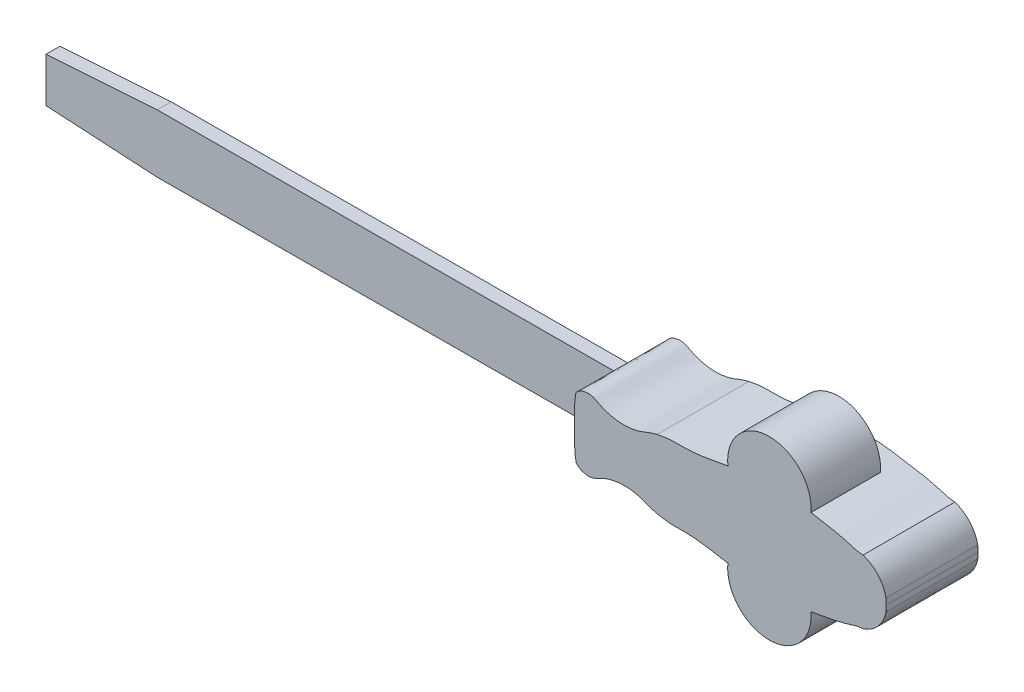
from build123d import *

# Parameters (mm, degrees)
BOSS_EXTRU_1_DEPTH      = 16.5
BOSS_EXTRU_1_DEPTH_BACK = 16.5
BOSS_EXTRU_3_DEPTH      = 25
BOSS_EXTRU_2_DEPTH      = 204
BOSS_EXTRU_2_DEPTH_BACK = 5
ESQUISSE2_W             = 5
ESQUISSE2_H             = 21
ENL_V_MAT_EXTRU_1_DEPTH = 208.421054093


with BuildPart() as part:
    # Esquisse1 → Boss.-Extru.1 (new, two sides: drawn at the far end of the back side and taken through both)
    with BuildSketch(Plane.XY.offset(-BOSS_EXTRU_1_DEPTH_BACK)):
        with BuildLine():
            add(Edge.make_bspline(
                [(-0.032865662, 3.401267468), (-0.224843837, 7.162553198), (0.44023693, 10.882257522)],
                knots=[0, 0, 0, 1, 1, 1], degree=2))
            add(Edge.make_bspline(
                [(0.44023693, 10.882257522), (1.254584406, 11.987068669), (3.198474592, 12.861745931), (6.069460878, 12.983670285), (8.102063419, 11.964714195), (10.410042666, 10.775554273), (13.186119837, 9.936569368), (16.542055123, 9.383749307), (20.171862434, 9.521311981), (24.057507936, 10.396311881), (27.077643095, 11.82091293), (29.045388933, 12.34115857), (29.658579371, 12.493288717)],
                knots=[0, 0, 0, 0, 0.120356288, 0.182103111, 0.252493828, 0.320379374, 0.416926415, 0.511670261, 0.625759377, 0.741661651, 0.867963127, 0.924773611, 0.924773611, 0.924773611, 0.924773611], degree=3))
            add(Edge.make_bspline(
                [(29.658579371, 12.493288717), (31.012865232, 12.750604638), (33.041458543, 13.211022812), (36.261256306, 13.256079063), (39.045258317, 13.257764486), (42.498505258, 13.390363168), (46.086926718, 13.792913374), (49.779062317, 14.488436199), (53.47784415, 15.15791922), (57.116896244, 15.727044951), (60.965789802, 16.271065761), (64.982894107, 16.626263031), (69.110135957, 17.089949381), (73.445124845, 17.062569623), (77.623582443, 16.967008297), (81.836310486, 16.32307468), (86.166989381, 15.637259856), (91.709301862, 14.738317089), (97.625170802, 13.482934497), (101.818778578, 11.944720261), (103.707407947, 11.990805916)],
                knots=[0, 0, 0, 0, 0.055398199, 0.08267741, 0.128818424, 0.167035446, 0.221096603, 0.273333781, 0.317568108, 0.371733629, 0.42094103, 0.473294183, 0.533363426, 0.587167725, 0.646878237, 0.700631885, 0.757710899, 0.822668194, 0.925588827, 1, 1, 1, 1], degree=3))
            add(Edge.make_bspline(
                [(103.707407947, 11.990805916), (105.281267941, 11.413367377), (109.12557011, 9.281811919), (111.416904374, 5.307594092), (111.901090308, 2.7335571)],
                knots=[0, 0, 0, 0, 0.390825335, 1, 1, 1, 1], degree=3))
            add(Edge.make_bspline(
                [(112, 0.541102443), (111.994702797, 1.637543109), (111.901090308, 2.7335571)],
                knots=[0.5, 0.5, 0.5, 1, 1, 1], degree=2))
            Line((112, 0.541102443), (0, 0))
            Line((0, 0), (-0.032865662, 3.401267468))
        make_face()
        with BuildLine():
            add(Edge.make_bspline(
                [(112, 0.541102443), (112.005297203, -0.555338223), (111.92227912, -1.652205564)],
                knots=[0.5, 0.5, 0.5, 1, 1, 1], degree=2))
            add(Edge.make_bspline(
                [(103.818425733, -10.988192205), (105.386632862, -10.395573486), (109.210159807, -8.226972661), (111.462986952, -4.230800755), (111.92227912, -1.652205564)],
                knots=[0, 0, 0, 0, 0.390825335, 1, 1, 1, 1], degree=3))
            add(Edge.make_bspline(
                [(29.777909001, -12.206134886), (31.13461791, -12.450353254), (33.16756523, -12.891149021), (36.387648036, -12.905092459), (39.171536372, -12.879877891), (42.625903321, -12.979104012), (46.218046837, -13.346962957), (49.916730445, -14.006778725), (53.621808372, -14.640491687), (57.266189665, -15.174429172), (61.120160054, -15.681235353), (65.140508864, -15.997601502), (69.272038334, -16.421387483), (73.606560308, -16.352122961), (77.783899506, -16.21619251), (81.990209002, -15.531584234), (86.314059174, -14.803957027), (91.847427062, -13.851504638), (97.750889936, -12.539019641), (101.929439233, -10.960357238), (103.818425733, -10.988192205)],
                knots=[0, 0, 0, 0, 0.055398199, 0.08267741, 0.128818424, 0.167035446, 0.221096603, 0.273333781, 0.317568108, 0.371733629, 0.42094103, 0.473294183, 0.533363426, 0.587167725, 0.646878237, 0.700631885, 0.757710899, 0.822668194, 0.925588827, 1, 1, 1, 1], degree=3))
            add(Edge.make_bspline(
                [(0.545364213, -10.877495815), (1.370348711, -11.974386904), (3.322599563, -12.830240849), (6.1946299, -12.924419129), (8.217292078, -11.885870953), (10.513673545, -10.674466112), (13.281514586, -9.808697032), (16.63195169, -9.223476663), (20.26291873, -9.325960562), (24.156837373, -10.163375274), (27.190596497, -11.558728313), (29.163277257, -12.059936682), (29.777909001, -12.206134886)],
                knots=[0, 0, 0, 0, 0.120356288, 0.182103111, 0.252493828, 0.320379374, 0.416926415, 0.511670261, 0.625759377, 0.741661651, 0.867963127, 0.924773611, 0.924773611, 0.924773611, 0.924773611], degree=3))
            add(Edge.make_bspline(
                [(0, -3.401426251), (-0.155626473, -7.164391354), (0.545364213, -10.877495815)],
                knots=[0, 0, 0, 1, 1, 1], degree=2))
            Line((0, -3.401426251), (0, 0))
            Line((0, 0), (112, 0.541102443))
        make_face()
    extrude(amount=BOSS_EXTRU_1_DEPTH + BOSS_EXTRU_1_DEPTH_BACK)

    # Esquisse3 → Boss.-Extru.3 (add)
    with BuildSketch(Plane.XY.offset(16.5)):
        with BuildLine():
            ThreePointArc((84.950754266, 15.828711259), (69.787759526, 32.041683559), (55.08959678, 15.406152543))
            add(Edge.make_bspline(
                [(55.08959678, 15.406152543), (55.806064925, 15.519773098), (57.737109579, 15.814708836), (60.965789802, 16.271065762), (64.982894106, 16.626263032), (69.110135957, 17.089949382), (73.445124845, 17.062569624), (77.623582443, 16.967008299), (81.49467982, 16.3752944), (83.885189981, 15.998375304), (84.950754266, 15.828711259)],
                knots=[0.342661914, 0.342661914, 0.342661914, 0.342661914, 0.371733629, 0.42094103, 0.473294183, 0.533363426, 0.587167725, 0.646878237, 0.700631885, 0.743880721, 0.743880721, 0.743880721, 0.743880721], degree=3))
        make_face()
        with BuildLine():
            ThreePointArc((55.076493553, -14.849370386), (69.907280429, -31.362013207), (84.941069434, -15.033975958))
            add(Edge.make_bspline(
                [(55.076493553, -14.849370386), (55.847054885, -14.96462114), (57.833943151, -15.249090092), (61.120160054, -15.681235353), (65.140508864, -15.997601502), (69.272038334, -16.421387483), (73.606560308, -16.352122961), (77.783899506, -16.21619251), (81.596072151, -15.595732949), (83.930053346, -15.204828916), (84.941069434, -15.033975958)],
                knots=[0.340509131, 0.340509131, 0.340509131, 0.340509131, 0.371733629, 0.42094103, 0.473294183, 0.533363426, 0.587167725, 0.646878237, 0.700631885, 0.741730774, 0.741730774, 0.741730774, 0.741730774], degree=3))
        make_face()
    extrude(amount=-BOSS_EXTRU_3_DEPTH)

    # Esquisse2 → Boss.-Extru.2 (add, two sides: drawn at the far end of the back side and taken through both)
    with BuildSketch(Plane(origin=(0, 0, 0), x_dir=(0, 0, 1), z_dir=(-0.9999883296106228, -0.004831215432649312, 0)).offset(-BOSS_EXTRU_2_DEPTH_BACK)):
        Rectangle(ESQUISSE2_W, ESQUISSE2_H)
    extrude(amount=BOSS_EXTRU_2_DEPTH + BOSS_EXTRU_2_DEPTH_BACK)

    # Esquisse4 → Enl_v. mat.-Extru.1 (cut, through all)
    with BuildSketch(Plane.XY.offset(2.5)):
        Polygon((-204.036268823, 7.014309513), (-164.048347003, 9.707560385), (-204.048347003, 9.514309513), align=None)
    enl_v_mat_extru_1 = extrude(amount=-ENL_V_MAT_EXTRU_1_DEPTH, mode=Mode.SUBTRACT)

    # Sym_trie1: Enl_v. mat.-Extru.1 across plane
    add(enl_v_mat_extru_1.mirror(Plane(origin=(0, 0, 0), x_dir=(0, 0, 1), z_dir=(-0.004831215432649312, 0.9999883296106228, 0))), mode=Mode.SUBTRACT)


solid = part.part
